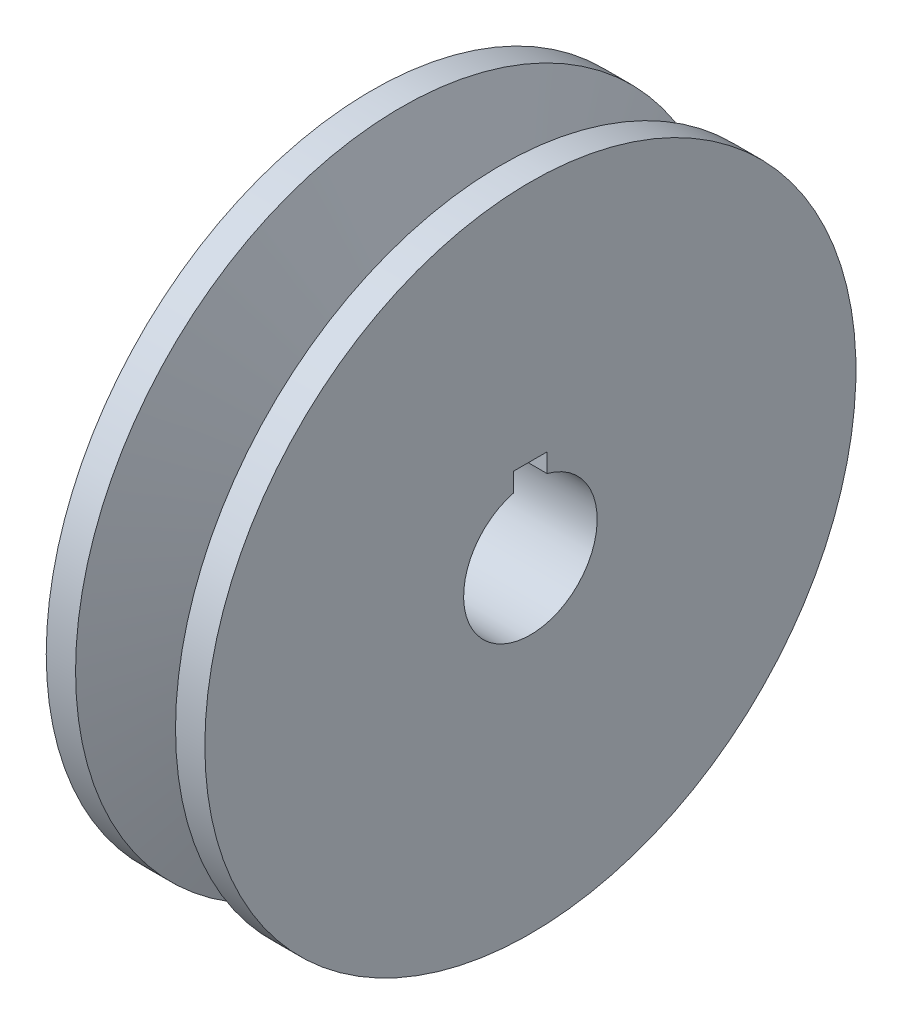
ISO-10303-21;
HEADER;
FILE_DESCRIPTION(('STEP AP214'),'2;1');
FILE_NAME('part.step','',(''),(''),'','','');
FILE_SCHEMA(('AUTOMOTIVE_DESIGN { 1 0 10303 214 1 1 1 1 }'));
ENDSEC;
DATA;
#1=APPLICATION_CONTEXT('core data for automotive mechanical design processes');
#2=APPLICATION_PROTOCOL_DEFINITION('international standard','automotive_design',2000,#1);
#3=PRODUCT_CONTEXT('',#1,'mechanical');
#4=PRODUCT('Part','Part','',(#3));
#5=PRODUCT_RELATED_PRODUCT_CATEGORY('part','',(#4));
#6=PRODUCT_DEFINITION_FORMATION('','',#4);
#7=PRODUCT_DEFINITION_CONTEXT('part definition',#1,'design');
#8=PRODUCT_DEFINITION('design','',#6,#7);
#9=PRODUCT_DEFINITION_SHAPE('','',#8);
#10=(LENGTH_UNIT() NAMED_UNIT(*) SI_UNIT(.MILLI.,.METRE.));
#11=(NAMED_UNIT(*) PLANE_ANGLE_UNIT() SI_UNIT($,.RADIAN.));
#12=(NAMED_UNIT(*) SI_UNIT($,.STERADIAN.) SOLID_ANGLE_UNIT());
#13=UNCERTAINTY_MEASURE_WITH_UNIT(LENGTH_MEASURE(1.E-05),#10,'distance_accuracy_value','');
#14=(GEOMETRIC_REPRESENTATION_CONTEXT(3) GLOBAL_UNCERTAINTY_ASSIGNED_CONTEXT((#13)) GLOBAL_UNIT_ASSIGNED_CONTEXT((#10,
#11,#12)) REPRESENTATION_CONTEXT('',''));
#15=CARTESIAN_POINT('',(0.,0.,0.));
#16=DIRECTION('',(0.,0.,1.));
#17=DIRECTION('',(1.,0.,0.));
#18=AXIS2_PLACEMENT_3D('',#15,#16,#17);
#19=CARTESIAN_POINT('',(0.,39.,0.));
#20=DIRECTION('',(1.,0.,0.));
#21=DIRECTION('',(0.,0.,-1.));
#22=AXIS2_PLACEMENT_3D('',#19,#20,#21);
#23=PLANE('',#22);
#24=CARTESIAN_POINT('',(0.,0.,0.));
#25=DIRECTION('',(1.,0.,0.));
#26=DIRECTION('',(0.,0.,-1.));
#27=AXIS2_PLACEMENT_3D('',#24,#25,#26);
#28=CIRCLE('',#27,8.);
#29=CARTESIAN_POINT('',(0.,7.74596669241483,2.));
#30=VERTEX_POINT('',#29);
#31=CARTESIAN_POINT('',(0.,7.74596669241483,-2.));
#32=VERTEX_POINT('',#31);
#33=EDGE_CURVE('E93',#30,#32,#28,.T.);
#34=ORIENTED_EDGE('',*,*,#33,.T.);
#35=DIRECTION('',(0.,1.,0.));
#36=VECTOR('',#35,1.);
#37=CARTESIAN_POINT('',(0.,10.,-2.));
#38=LINE('',#37,#36);
#39=CARTESIAN_POINT('',(0.,10.,-2.));
#40=VERTEX_POINT('',#39);
#41=EDGE_CURVE('E84',#32,#40,#38,.T.);
#42=ORIENTED_EDGE('',*,*,#41,.T.);
#43=DIRECTION('',(0.,0.,1.));
#44=VECTOR('',#43,1.);
#45=CARTESIAN_POINT('',(0.,10.,2.));
#46=LINE('',#45,#44);
#47=CARTESIAN_POINT('',(0.,10.,2.));
#48=VERTEX_POINT('',#47);
#49=EDGE_CURVE('E90',#40,#48,#46,.T.);
#50=ORIENTED_EDGE('',*,*,#49,.T.);
#51=DIRECTION('',(0.,-1.,0.));
#52=VECTOR('',#51,1.);
#53=CARTESIAN_POINT('',(0.,10.,2.));
#54=LINE('',#53,#52);
#55=EDGE_CURVE('E38',#48,#30,#54,.T.);
#56=ORIENTED_EDGE('',*,*,#55,.T.);
#57=EDGE_LOOP('',(#34,#42,#50,#56));
#58=FACE_BOUND('',#57,.T.);
#59=CARTESIAN_POINT('',(0.,0.,0.));
#60=DIRECTION('',(-1.,0.,0.));
#61=DIRECTION('',(0.,0.,1.));
#62=AXIS2_PLACEMENT_3D('',#59,#60,#61);
#63=CIRCLE('',#62,39.);
#64=CARTESIAN_POINT('',(0.,0.,39.));
#65=VERTEX_POINT('',#64);
#66=EDGE_CURVE('E98',#65,#65,#63,.T.);
#67=ORIENTED_EDGE('',*,*,#66,.T.);
#68=EDGE_LOOP('',(#67));
#69=FACE_BOUND('',#68,.T.);
#70=ADVANCED_FACE('F24',(#58,#69),#23,.F.);
#71=CARTESIAN_POINT('',(19.,0.,0.));
#72=DIRECTION('',(-1.,0.,0.));
#73=DIRECTION('',(0.,0.,1.));
#74=AXIS2_PLACEMENT_3D('',#71,#72,#73);
#75=PLANE('',#74);
#76=DIRECTION('',(0.,0.,1.));
#77=VECTOR('',#76,1.);
#78=CARTESIAN_POINT('',(19.,10.,2.));
#79=LINE('',#78,#77);
#80=CARTESIAN_POINT('',(19.,10.,-2.));
#81=VERTEX_POINT('',#80);
#82=CARTESIAN_POINT('',(19.,10.,2.));
#83=VERTEX_POINT('',#82);
#84=EDGE_CURVE('E75',#81,#83,#79,.T.);
#85=ORIENTED_EDGE('',*,*,#84,.F.);
#86=DIRECTION('',(0.,1.,0.));
#87=VECTOR('',#86,1.);
#88=CARTESIAN_POINT('',(19.,10.,-2.));
#89=LINE('',#88,#87);
#90=CARTESIAN_POINT('',(19.,7.74596669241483,-2.));
#91=VERTEX_POINT('',#90);
#92=EDGE_CURVE('E46',#91,#81,#89,.T.);
#93=ORIENTED_EDGE('',*,*,#92,.F.);
#94=CARTESIAN_POINT('',(19.,0.,0.));
#95=DIRECTION('',(1.,0.,0.));
#96=DIRECTION('',(0.,0.,-1.));
#97=AXIS2_PLACEMENT_3D('',#94,#95,#96);
#98=CIRCLE('',#97,8.);
#99=CARTESIAN_POINT('',(19.,7.74596669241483,2.));
#100=VERTEX_POINT('',#99);
#101=EDGE_CURVE('E82',#100,#91,#98,.T.);
#102=ORIENTED_EDGE('',*,*,#101,.F.);
#103=DIRECTION('',(0.,-1.,0.));
#104=VECTOR('',#103,1.);
#105=CARTESIAN_POINT('',(19.,10.,2.));
#106=LINE('',#105,#104);
#107=EDGE_CURVE('E66',#83,#100,#106,.T.);
#108=ORIENTED_EDGE('',*,*,#107,.F.);
#109=EDGE_LOOP('',(#85,#93,#102,#108));
#110=FACE_BOUND('',#109,.T.);
#111=CARTESIAN_POINT('',(19.,0.,0.));
#112=DIRECTION('',(-1.,0.,0.));
#113=DIRECTION('',(0.,0.,1.));
#114=AXIS2_PLACEMENT_3D('',#111,#112,#113);
#115=CIRCLE('',#114,39.);
#116=CARTESIAN_POINT('',(19.,0.,39.));
#117=VERTEX_POINT('',#116);
#118=EDGE_CURVE('E11',#117,#117,#115,.T.);
#119=ORIENTED_EDGE('',*,*,#118,.F.);
#120=EDGE_LOOP('',(#119));
#121=FACE_BOUND('',#120,.T.);
#122=ADVANCED_FACE('F79',(#110,#121),#75,.F.);
#123=CARTESIAN_POINT('',(19.,0.,0.));
#124=DIRECTION('',(-1.,0.,0.));
#125=DIRECTION('',(0.,0.,1.));
#126=AXIS2_PLACEMENT_3D('',#123,#124,#125);
#127=CYLINDRICAL_SURFACE('',#126,39.);
#128=CARTESIAN_POINT('',(15.4873795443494,0.,0.));
#129=DIRECTION('',(-1.,0.,0.));
#130=DIRECTION('',(0.,0.,1.));
#131=AXIS2_PLACEMENT_3D('',#128,#129,#130);
#132=CIRCLE('',#131,39.);
#133=CARTESIAN_POINT('',(15.4873795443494,0.,39.));
#134=VERTEX_POINT('',#133);
#135=EDGE_CURVE('E31',#134,#134,#132,.T.);
#136=ORIENTED_EDGE('',*,*,#135,.F.);
#137=EDGE_LOOP('',(#136));
#138=FACE_BOUND('',#137,.T.);
#139=ORIENTED_EDGE('',*,*,#118,.T.);
#140=EDGE_LOOP('',(#139));
#141=FACE_BOUND('',#140,.T.);
#142=ADVANCED_FACE('F116',(#138,#141),#127,.T.);
#143=CARTESIAN_POINT('',(15.4873795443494,0.,0.));
#144=DIRECTION('',(1.,0.,0.));
#145=DIRECTION('',(0.,0.,-1.));
#146=AXIS2_PLACEMENT_3D('',#143,#144,#145);
#147=CONICAL_SURFACE('',#146,39.,1.25663706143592);
#148=CARTESIAN_POINT('',(11.425883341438,0.,0.));
#149=DIRECTION('',(-1.,0.,0.));
#150=DIRECTION('',(0.,0.,1.));
#151=AXIS2_PLACEMENT_3D('',#148,#149,#150);
#152=CIRCLE('',#151,26.5);
#153=CARTESIAN_POINT('',(11.425883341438,0.,26.5));
#154=VERTEX_POINT('',#153);
#155=EDGE_CURVE('E109',#154,#154,#152,.T.);
#156=ORIENTED_EDGE('',*,*,#155,.F.);
#157=EDGE_LOOP('',(#156));
#158=FACE_BOUND('',#157,.T.);
#159=ORIENTED_EDGE('',*,*,#135,.T.);
#160=EDGE_LOOP('',(#159));
#161=FACE_BOUND('',#160,.T.);
#162=ADVANCED_FACE('F114',(#158,#161),#147,.T.);
#163=CARTESIAN_POINT('',(19.,0.,0.));
#164=DIRECTION('',(-1.,0.,0.));
#165=DIRECTION('',(0.,0.,1.));
#166=AXIS2_PLACEMENT_3D('',#163,#164,#165);
#167=CYLINDRICAL_SURFACE('',#166,26.5);
#168=CARTESIAN_POINT('',(7.57411665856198,0.,0.));
#169=DIRECTION('',(-1.,0.,0.));
#170=DIRECTION('',(0.,0.,1.));
#171=AXIS2_PLACEMENT_3D('',#168,#169,#170);
#172=CIRCLE('',#171,26.5);
#173=CARTESIAN_POINT('',(7.57411665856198,0.,26.5));
#174=VERTEX_POINT('',#173);
#175=EDGE_CURVE('E106',#174,#174,#172,.T.);
#176=ORIENTED_EDGE('',*,*,#175,.F.);
#177=EDGE_LOOP('',(#176));
#178=FACE_BOUND('',#177,.T.);
#179=ORIENTED_EDGE('',*,*,#155,.T.);
#180=EDGE_LOOP('',(#179));
#181=FACE_BOUND('',#180,.T.);
#182=ADVANCED_FACE('F130',(#178,#181),#167,.T.);
#183=CARTESIAN_POINT('',(7.57411665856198,0.,0.));
#184=DIRECTION('',(-1.,0.,0.));
#185=DIRECTION('',(0.,0.,1.));
#186=AXIS2_PLACEMENT_3D('',#183,#184,#185);
#187=CONICAL_SURFACE('',#186,26.5,1.25663706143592);
#188=CARTESIAN_POINT('',(3.51262045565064,0.,0.));
#189=DIRECTION('',(-1.,0.,0.));
#190=DIRECTION('',(0.,0.,1.));
#191=AXIS2_PLACEMENT_3D('',#188,#189,#190);
#192=CIRCLE('',#191,39.);
#193=CARTESIAN_POINT('',(3.51262045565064,0.,39.));
#194=VERTEX_POINT('',#193);
#195=EDGE_CURVE('E103',#194,#194,#192,.T.);
#196=ORIENTED_EDGE('',*,*,#195,.F.);
#197=EDGE_LOOP('',(#196));
#198=FACE_BOUND('',#197,.T.);
#199=ORIENTED_EDGE('',*,*,#175,.T.);
#200=EDGE_LOOP('',(#199));
#201=FACE_BOUND('',#200,.T.);
#202=ADVANCED_FACE('F134',(#198,#201),#187,.T.);
#203=CARTESIAN_POINT('',(19.,0.,0.));
#204=DIRECTION('',(-1.,0.,0.));
#205=DIRECTION('',(0.,0.,1.));
#206=AXIS2_PLACEMENT_3D('',#203,#204,#205);
#207=CYLINDRICAL_SURFACE('',#206,39.);
#208=ORIENTED_EDGE('',*,*,#66,.F.);
#209=EDGE_LOOP('',(#208));
#210=FACE_BOUND('',#209,.T.);
#211=ORIENTED_EDGE('',*,*,#195,.T.);
#212=EDGE_LOOP('',(#211));
#213=FACE_BOUND('',#212,.T.);
#214=ADVANCED_FACE('F138',(#210,#213),#207,.T.);
#215=CARTESIAN_POINT('',(0.,10.,-2.));
#216=DIRECTION('',(0.,0.,-1.));
#217=DIRECTION('',(-1.,0.,0.));
#218=AXIS2_PLACEMENT_3D('',#215,#216,#217);
#219=PLANE('',#218);
#220=ORIENTED_EDGE('',*,*,#92,.T.);
#221=DIRECTION('',(1.,0.,0.));
#222=VECTOR('',#221,1.);
#223=CARTESIAN_POINT('',(0.,10.,-2.));
#224=LINE('',#223,#222);
#225=EDGE_CURVE('E72',#40,#81,#224,.T.);
#226=ORIENTED_EDGE('',*,*,#225,.F.);
#227=ORIENTED_EDGE('',*,*,#41,.F.);
#228=DIRECTION('',(1.,0.,0.));
#229=VECTOR('',#228,1.);
#230=CARTESIAN_POINT('',(0.,7.74596669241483,-2.));
#231=LINE('',#230,#229);
#232=EDGE_CURVE('E96',#32,#91,#231,.T.);
#233=ORIENTED_EDGE('',*,*,#232,.T.);
#234=EDGE_LOOP('',(#220,#226,#227,#233));
#235=FACE_BOUND('',#234,.T.);
#236=ADVANCED_FACE('F142',(#235),#219,.F.);
#237=CARTESIAN_POINT('',(0.,0.,0.));
#238=DIRECTION('',(1.,0.,0.));
#239=DIRECTION('',(0.,0.,-1.));
#240=AXIS2_PLACEMENT_3D('',#237,#238,#239);
#241=CYLINDRICAL_SURFACE('',#240,8.);
#242=ORIENTED_EDGE('',*,*,#101,.T.);
#243=ORIENTED_EDGE('',*,*,#232,.F.);
#244=ORIENTED_EDGE('',*,*,#33,.F.);
#245=DIRECTION('',(1.,0.,0.));
#246=VECTOR('',#245,1.);
#247=CARTESIAN_POINT('',(0.,7.74596669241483,2.));
#248=LINE('',#247,#246);
#249=EDGE_CURVE('E71',#30,#100,#248,.T.);
#250=ORIENTED_EDGE('',*,*,#249,.T.);
#251=EDGE_LOOP('',(#242,#243,#244,#250));
#252=FACE_BOUND('',#251,.T.);
#253=ADVANCED_FACE('F145',(#252),#241,.F.);
#254=CARTESIAN_POINT('',(0.,10.,2.));
#255=DIRECTION('',(0.,0.,1.));
#256=DIRECTION('',(0.,-1.,0.));
#257=AXIS2_PLACEMENT_3D('',#254,#255,#256);
#258=PLANE('',#257);
#259=ORIENTED_EDGE('',*,*,#107,.T.);
#260=ORIENTED_EDGE('',*,*,#249,.F.);
#261=ORIENTED_EDGE('',*,*,#55,.F.);
#262=DIRECTION('',(1.,0.,0.));
#263=VECTOR('',#262,1.);
#264=CARTESIAN_POINT('',(0.,10.,2.));
#265=LINE('',#264,#263);
#266=EDGE_CURVE('E62',#48,#83,#265,.T.);
#267=ORIENTED_EDGE('',*,*,#266,.T.);
#268=EDGE_LOOP('',(#259,#260,#261,#267));
#269=FACE_BOUND('',#268,.T.);
#270=ADVANCED_FACE('F64',(#269),#258,.F.);
#271=CARTESIAN_POINT('',(0.,10.,2.));
#272=DIRECTION('',(0.,1.,0.));
#273=DIRECTION('',(0.,0.,1.));
#274=AXIS2_PLACEMENT_3D('',#271,#272,#273);
#275=PLANE('',#274);
#276=ORIENTED_EDGE('',*,*,#84,.T.);
#277=ORIENTED_EDGE('',*,*,#266,.F.);
#278=ORIENTED_EDGE('',*,*,#49,.F.);
#279=ORIENTED_EDGE('',*,*,#225,.T.);
#280=EDGE_LOOP('',(#276,#277,#278,#279));
#281=FACE_BOUND('',#280,.T.);
#282=ADVANCED_FACE('F76',(#281),#275,.F.);
#283=CLOSED_SHELL('',(#70,#122,#142,#162,#182,#202,#214,#236,#253,#270,#282));
#284=MANIFOLD_SOLID_BREP('B2',#283);
#285=ADVANCED_BREP_SHAPE_REPRESENTATION('',(#18,#284),#14);
#286=SHAPE_DEFINITION_REPRESENTATION(#9,#285);
ENDSEC;
END-ISO-10303-21;
